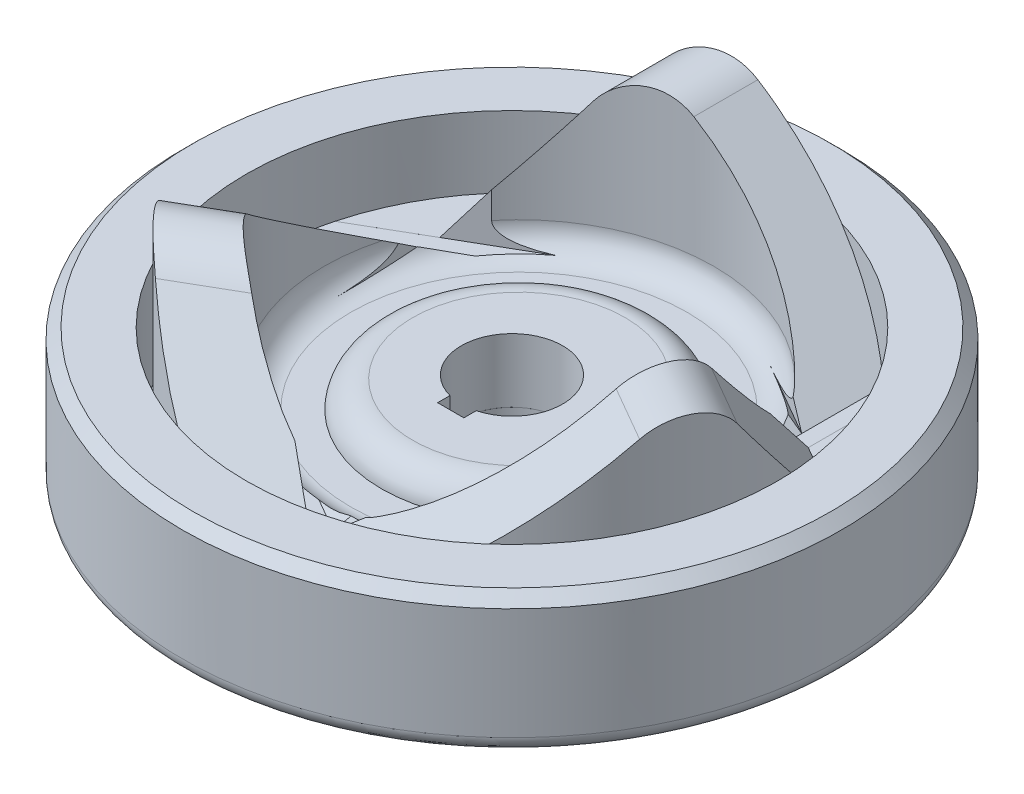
from build123d import *

# Parameters (mm, degrees)
CORTAR_EXTRUIR1_DEPTH = 82.972618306
MATRIZC1_COUNT        = 3
CORTAR_EXTRUIR2_DEPTH = 29.08
CROQUIS6_R            = 31
CROQUIS6_R_2          = 22
EXTRUIR1_DEPTH        = 2
CROQUIS6_3_R          = 17
EXTRUIR2_DEPTH        = 4.5
CORTAR_EXTRUIR4_DEPTH = 100.7214822
CORTAR_EXTRUIR5_DEPTH = 6
REDONDEO1_R           = 3
CHAFL_N1_SIZE         = 2


with BuildPart() as part:
    # Croquis1 → Revoluci_n1 (revolve)
    with BuildSketch(Plane.XY, mode=Mode.PRIVATE) as revoluci_n1_sk:
        with BuildLine():
            Line((1.312114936, 6), (1.312114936, 18))
            Line((1.312114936, 18), (21.312114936, 18))
            ThreePointArc((21.312114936, 18), (25.269620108, 16.710320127), (27.156057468, 13))
            Line((27.156057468, 13), (33, 13))
            ThreePointArc((33, 13), (36.535533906, 14.464466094), (38, 18))
            Line((38, 18), (38, 43))
            Line((38, 43), (50, 43))
            Line((50, 43), (50, 6))
            Line((50, 6), (1.312114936, 6))
        make_face()
    revolve(revoluci_n1_sk.sketch.rotate(Axis((1.312114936, 6, 0), (0, 1, 0)), 90), axis=Axis((1.312114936, 6, 0), (0, 1, 0)))

    # Croquis2 → Cortar-Extruir1 (cut, through all)
    with BuildSketch(Plane.XY):
        with BuildLine():
            Line((-33.265114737, 13.919352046), (-33.265114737, 45.892330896))
            Line((-33.265114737, 45.892330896), (35.637528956, 45.892330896))
            Line((35.637528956, 45.892330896), (35.637528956, 13.919352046))
            Line((35.637528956, 13.919352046), (32.729864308, 13.919352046))
            Line((32.729864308, 13.919352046), (-2.295566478, 40.669105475))
            ThreePointArc((-2.295566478, 40.669105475), (-9.962249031, 42.593400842), (-16.631043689, 38.349804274))
            Line((-16.631043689, 38.349804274), (-33.265114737, 13.919352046))
        make_face()
    cortar_extruir1 = extrude(amount=-CORTAR_EXTRUIR1_DEPTH, mode=Mode.SUBTRACT)

    # MatrizC1: Cortar-Extruir1 ×3 about axis
    matrizc1_axis = Axis((1.312114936, 0, 0), (0, 1, 0))
    for i in range(1, MATRIZC1_COUNT):
        add(cortar_extruir1.rotate(matrizc1_axis, i * 360 / MATRIZC1_COUNT), mode=Mode.SUBTRACT)

    # Croquis3 → Cortar-Extruir2 (cut)
    with BuildSketch(Plane(origin=(0, 43, 0), x_dir=(-1, 0, 0), z_dir=(0, 1, 0))):
        with BuildLine():
            Line((33.265114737, -19.672401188), (33.265114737, -43.260057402))
            Line((33.265114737, -43.260057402), (40.185160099, -50.180102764))
            ThreePointArc((40.185160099, -50.180102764), (54.989300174, -33.302652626), (63.087428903, -12.363903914))
            Line((63.087428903, -12.363903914), (50.27347577, -9.852619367))
            Line((50.27347577, -9.852619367), (33.265114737, -19.672401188))
        make_face()
        with BuildLine():
            Line((14.316363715, 48.949452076), (-1.56393059, 39.780959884))
            Line((-1.56393059, 39.780959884), (-20.850076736, 50.915821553))
            Line((-20.850076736, 50.915821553), (-24.362275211, 59.492599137))
            ThreePointArc((-24.362275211, 59.492599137), (-3.3457288, 64.200435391), (18.046328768, 61.702672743))
            Line((18.046328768, 61.702672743), (14.316363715, 48.949452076))
        make_face()
        with BuildLine():
            Line((-35.637528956, -20.108558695), (-35.637528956, -43.260057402))
            Line((-35.637528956, -43.260057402), (-41.486850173, -49.109378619))
            ThreePointArc((-41.486850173, -49.109378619), (-56.446994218, -30.767298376), (-63.755412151, -8.254527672))
            Line((-63.755412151, -8.254527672), (-56.169312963, -8.254527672))
            Line((-56.169312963, -8.254527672), (-35.637528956, -20.108558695))
        make_face()
    extrude(amount=-CORTAR_EXTRUIR2_DEPTH, mode=Mode.SUBTRACT)


with BuildPart() as body_2:
    # Croquis5 → Revoluci_n4 (revolve)
    with BuildSketch(Plane.XY, mode=Mode.PRIVATE) as revoluci_n4_sk:
        Polygon((61.999, -0.278237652), (-0.001, -0.278237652), (-0.001, 5.991762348), (50, 6), (50, 25.721762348), (61.999, 25.721762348), align=None)
    revolve(revoluci_n4_sk.sketch.rotate(Axis((-0.001, -0.278237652, 0), (0, 1, 0)), 90), axis=Axis((-0.001, -0.278237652, 0), (0, 1, 0)))

    # Croquis6 → Extruir1 (add)
    with BuildSketch(Plane.XZ.offset(0.278237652)):
        with Locations(Location((0, 0, 0), (0, 0, 270))):
            Circle(CROQUIS6_R)
        with Locations(Location((0, 0, 0), (0, 0, 270))):
            Circle(CROQUIS6_R_2, mode=Mode.SUBTRACT)
    extrude(amount=EXTRUIR1_DEPTH)

    # Croquis6_3 → Extruir2 (add)
    with BuildSketch(Plane.XZ.offset(0.278237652)):
        with Locations(Location((0, 0, 0), (0, 0, 270))):
            Circle(CROQUIS6_3_R)
    extrude(amount=EXTRUIR2_DEPTH)


with BuildPart() as cortar_extruir4_tool:
    # Croquis7 → Cortar-Extruir4 (new, through all)
    with BuildSketch(Plane.XZ.offset(4.778237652)):
        with BuildLine():
            Line((-2.472137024, 11.525), (-2.472137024, 9.198595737))
            ThreePointArc((-2.472137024, 9.198595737), (0, -9.525), (2.472137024, 9.198595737))
            Line((2.472137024, 9.198595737), (2.472137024, 11.525))
            Line((2.472137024, 11.525), (-2.472137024, 11.525))
        make_face()
    extrude(amount=-CORTAR_EXTRUIR4_DEPTH)


with BuildPart() as part_1:
    add(part.part)

    # Cortar-Extruir4: cut by cortar_extruir4_tool
    add(cortar_extruir4_tool.part, mode=Mode.SUBTRACT)


with BuildPart() as body_2_1:
    add(body_2.part)

    # Cortar-Extruir4: cut by cortar_extruir4_tool
    add(cortar_extruir4_tool.part, mode=Mode.SUBTRACT)

    # Croquis8 → Cortar-Extruir5 (cut)
    with BuildSketch(Plane.XZ.offset(0.278237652)):
        with BuildLine():
            Line((-1.999467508, 43.715120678), (-1.999374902, 39.95))
            ThreePointArc((-1.999374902, 39.95), (-20, 34.641016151), (-33.59802743, 21.706509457))
            Line((-33.59802743, 21.706509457), (-36.858671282, 23.589149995))
            ThreePointArc((-36.858671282, 23.589149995), (-38.295880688, 25.576922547), (-37.769421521, 27.972679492))
            ThreePointArc((-37.769421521, 27.972679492), (-23.5, 40.703193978), (-5.340340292, 46.695618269))
            ThreePointArc((-5.340340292, 46.695618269), (-3.002324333, 45.953666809), (-1.999467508, 43.715120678))
        make_face()
        with BuildLine():
            Line((1.999467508, 43.715120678), (1.999374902, 39.95))
            ThreePointArc((1.999374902, 39.95), (20, 34.641016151), (33.59802743, 21.706509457))
            Line((33.59802743, 21.706509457), (36.858671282, 23.589149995))
            ThreePointArc((36.858671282, 23.589149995), (38.295880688, 25.576922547), (37.769421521, 27.972679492))
            ThreePointArc((37.769421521, 27.972679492), (23.5, 40.703193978), (5.340340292, 46.695618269))
            ThreePointArc((5.340340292, 46.695618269), (3.002324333, 45.953666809), (1.999467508, 43.715120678))
        make_face()
        with BuildLine():
            Line((38.85813879, 20.125970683), (35.597402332, 18.243490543))
            ThreePointArc((35.597402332, 18.243490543), (40, 0), (35.597402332, -18.243490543))
            Line((35.597402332, -18.243490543), (38.85813879, -20.125970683))
            ThreePointArc((38.85813879, -20.125970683), (41.29820502, -20.376744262), (43.109761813, -18.722938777))
            ThreePointArc((43.109761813, -18.722938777), (47, 0), (43.109761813, 18.722938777))
            ThreePointArc((43.109761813, 18.722938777), (41.29820502, 20.376744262), (38.85813879, 20.125970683))
        make_face()
        with BuildLine():
            Line((33.59802743, -21.706509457), (36.858671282, -23.589149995))
            ThreePointArc((36.858671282, -23.589149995), (38.295880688, -25.576922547), (37.769421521, -27.972679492))
            ThreePointArc((37.769421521, -27.972679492), (23.5, -40.703193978), (5.340340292, -46.695618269))
            ThreePointArc((5.340340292, -46.695618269), (3.002324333, -45.953666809), (1.999467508, -43.715120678))
            Line((1.999467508, -43.715120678), (1.999374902, -39.95))
            ThreePointArc((1.999374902, -39.95), (20, -34.641016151), (33.59802743, -21.706509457))
        make_face()
        with BuildLine():
            Line((-1.999374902, -39.95), (-1.999467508, -43.715120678))
            ThreePointArc((-1.999467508, -43.715120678), (-3.002324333, -45.953666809), (-5.340340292, -46.695618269))
            ThreePointArc((-5.340340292, -46.695618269), (-23.5, -40.703193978), (-37.769421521, -27.972679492))
            ThreePointArc((-37.769421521, -27.972679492), (-38.295880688, -25.576922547), (-36.858671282, -23.589149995))
            Line((-36.858671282, -23.589149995), (-33.59802743, -21.706509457))
            ThreePointArc((-33.59802743, -21.706509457), (-20, -34.641016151), (-1.999374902, -39.95))
        make_face()
        with BuildLine():
            Line((-38.85813879, -20.125970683), (-35.597402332, -18.243490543))
            ThreePointArc((-35.597402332, -18.243490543), (-40, 0), (-35.597402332, 18.243490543))
            Line((-35.597402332, 18.243490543), (-38.85813879, 20.125970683))
            ThreePointArc((-38.85813879, 20.125970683), (-41.29820502, 20.376744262), (-43.109761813, 18.722938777))
            ThreePointArc((-43.109761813, 18.722938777), (-47, 0), (-43.109761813, -18.722938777))
            ThreePointArc((-43.109761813, -18.722938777), (-41.29820502, -20.376744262), (-38.85813879, -20.125970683))
        make_face()
    extrude(amount=-CORTAR_EXTRUIR5_DEPTH, mode=Mode.SUBTRACT)

    # Redondeo1
    redondeo1_edges = [body_2_1.edges().sort_by_distance(p)[0] for p in [
        (-0.001, -0.278237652, 62),
    ]]
    fillet(redondeo1_edges, radius=REDONDEO1_R)

    # Chafl_n1
    chafl_n1_edges = [body_2_1.edges().sort_by_distance(p)[0] for p in [
        (-0.001, 25.721762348, 62),
    ]]
    chamfer(chafl_n1_edges, length=CHAFL_N1_SIZE)


solid = Compound([part_1.part, body_2_1.part])
